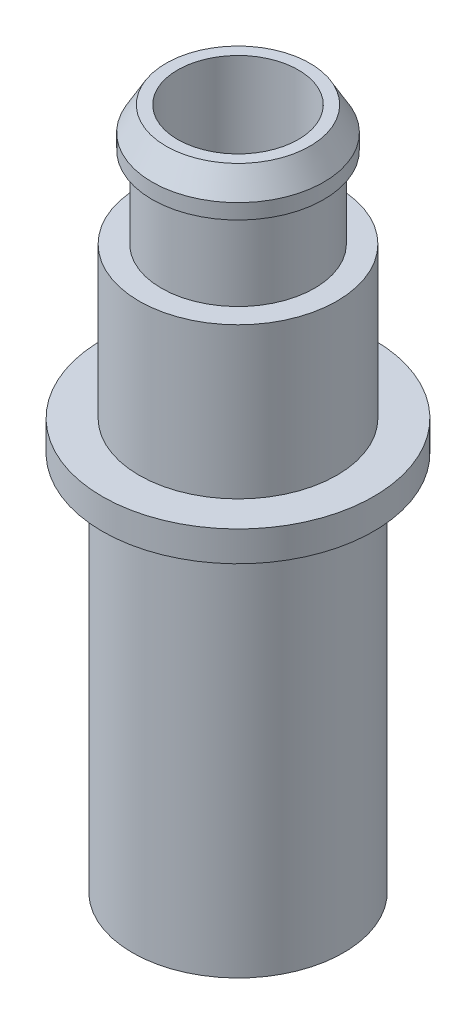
from build123d import *

# Parameters (mm, degrees)
SKETCH1_R           = 22.225
SKETCH1_R_2         = 12.7
BOSS_EXTRUDE1_DEPTH = 80.01
BOSS_EXTRUDE2_START = 6.35
SKETCH2_R           = 28.575
SKETCH2_R_2         = 12.7
BOSS_EXTRUDE2_DEPTH = 6.35
BOSS_EXTRUDE4_START = 31.75
SKETCH4_R           = 20.828
SKETCH4_R_2         = 12.7
BOSS_EXTRUDE4_DEPTH = 31.75
BOSS_EXTRUDE3_START = 25.4
SKETCH3_R           = 16.129
SKETCH3_R_2         = 12.7
BOSS_EXTRUDE3_DEPTH = 25.4
SKETCH5_R           = 18.0721
SKETCH5_R_2         = 12.7
BOSS_EXTRUDE5_DEPTH = 8.255
CHAMFER1_SIZE       = 5.08
CHAMFER1_SIZE2      = 2.932939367


with BuildPart() as part:
    # Sketch1 → Boss-Extrude1 (new body)
    with BuildSketch(Plane(origin=(0, 0, 0), x_dir=(1, 0, 0), z_dir=(0, 1, 0))):
        with Locations(Location((0, 0, 0), (0, 0, 270))):
            Circle(SKETCH1_R)
        with Locations(Location((0, 0, 0), (0, 0, 270))):
            Circle(SKETCH1_R_2, mode=Mode.SUBTRACT)
    extrude(amount=-BOSS_EXTRUDE1_DEPTH)

    # Sketch2 → Boss-Extrude2 (add)
    with BuildSketch(Plane(origin=(0, 0, 0), x_dir=(1, 0, 0), z_dir=(0, 1, 0)).offset(BOSS_EXTRUDE2_START)):
        with Locations(Location((0, 0, 0), (0, 0, 270))):
            Circle(SKETCH2_R)
        with Locations(Location((0, 0, 0), (0, 0, 270))):
            Circle(SKETCH2_R_2, mode=Mode.SUBTRACT)
    extrude(amount=-BOSS_EXTRUDE2_DEPTH)

    # Sketch4 → Boss-Extrude4 (add)
    with BuildSketch(Plane(origin=(0, 6.35, 0), x_dir=(1, 0, 0), z_dir=(0, 1, 0)).offset(BOSS_EXTRUDE4_START)):
        with Locations(Location((0, 0, 0), (0, 0, 270))):
            Circle(SKETCH4_R)
        with Locations(Location((0, 0, 0), (0, 0, 270))):
            Circle(SKETCH4_R_2, mode=Mode.SUBTRACT)
    extrude(amount=-BOSS_EXTRUDE4_DEPTH)

    # Sketch3 → Boss-Extrude3 (add)
    with BuildSketch(Plane(origin=(0, 38.1, 0), x_dir=(1, 0, 0), z_dir=(0, 1, 0)).offset(BOSS_EXTRUDE3_START)):
        with Locations(Location((0, 0, 0), (0, 0, 270))):
            Circle(SKETCH3_R)
        with Locations(Location((0, 0, 0), (0, 0, 270))):
            Circle(SKETCH3_R_2, mode=Mode.SUBTRACT)
    extrude(amount=-BOSS_EXTRUDE3_DEPTH)

    # Sketch5 → Boss-Extrude5 (add)
    with BuildSketch(Plane(origin=(0, 63.5, 0), x_dir=(1, 0, 0), z_dir=(0, 1, 0))):
        with Locations(Location((0, 0, 0), (0, 0, 270))):
            Circle(SKETCH5_R)
        with Locations(Location((0, 0, 0), (0, 0, 270))):
            Circle(SKETCH5_R_2, mode=Mode.SUBTRACT)
    extrude(amount=-BOSS_EXTRUDE5_DEPTH)

    # Chamfer1
    chamfer1_edges = [part.edges().sort_by_distance(p)[0] for p in [
        (0, 63.5, -18.0721),
    ]]
    chamfer1_side = [part.faces().sort_by_distance(p)[0] for p in [
        (0, 59.3725, -18.0721),
    ]]
    chamfer(chamfer1_edges, length=CHAMFER1_SIZE, length2=CHAMFER1_SIZE2, reference=chamfer1_side[0])


solid = part.part
